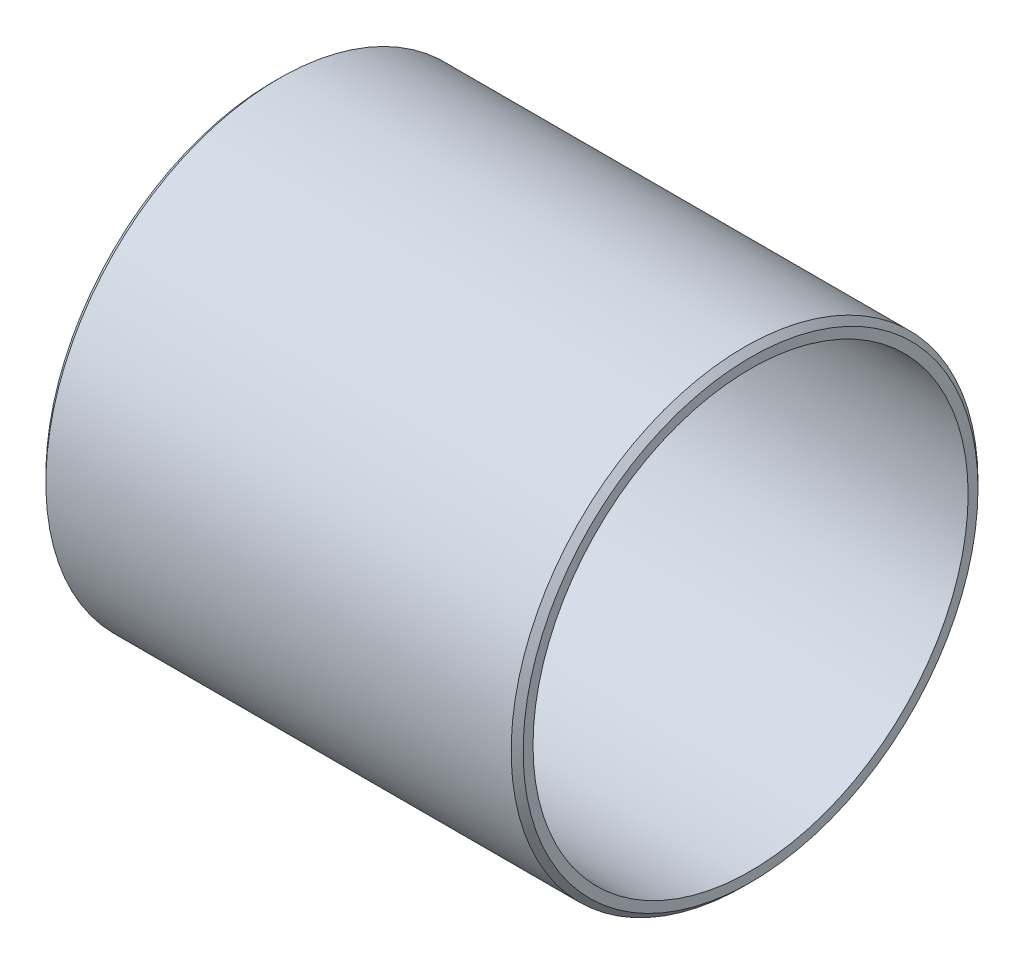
ISO-10303-21;
HEADER;
FILE_DESCRIPTION(('STEP AP214'),'2;1');
FILE_NAME('part.step','',(''),(''),'','','');
FILE_SCHEMA(('AUTOMOTIVE_DESIGN { 1 0 10303 214 1 1 1 1 }'));
ENDSEC;
DATA;
#1=APPLICATION_CONTEXT('core data for automotive mechanical design processes');
#2=APPLICATION_PROTOCOL_DEFINITION('international standard','automotive_design',2000,#1);
#3=PRODUCT_CONTEXT('',#1,'mechanical');
#4=PRODUCT('Part','Part','',(#3));
#5=PRODUCT_RELATED_PRODUCT_CATEGORY('part','',(#4));
#6=PRODUCT_DEFINITION_FORMATION('','',#4);
#7=PRODUCT_DEFINITION_CONTEXT('part definition',#1,'design');
#8=PRODUCT_DEFINITION('design','',#6,#7);
#9=PRODUCT_DEFINITION_SHAPE('','',#8);
#10=(LENGTH_UNIT() NAMED_UNIT(*) SI_UNIT(.MILLI.,.METRE.));
#11=(NAMED_UNIT(*) PLANE_ANGLE_UNIT() SI_UNIT($,.RADIAN.));
#12=(NAMED_UNIT(*) SI_UNIT($,.STERADIAN.) SOLID_ANGLE_UNIT());
#13=UNCERTAINTY_MEASURE_WITH_UNIT(LENGTH_MEASURE(1.E-05),#10,'distance_accuracy_value','');
#14=(GEOMETRIC_REPRESENTATION_CONTEXT(3) GLOBAL_UNCERTAINTY_ASSIGNED_CONTEXT((#13)) GLOBAL_UNIT_ASSIGNED_CONTEXT((#10,
#11,#12)) REPRESENTATION_CONTEXT('',''));
#15=CARTESIAN_POINT('',(0.,0.,0.));
#16=DIRECTION('',(0.,0.,1.));
#17=DIRECTION('',(1.,0.,0.));
#18=AXIS2_PLACEMENT_3D('',#15,#16,#17);
#19=CARTESIAN_POINT('',(31.623,0.,0.));
#20=DIRECTION('',(1.,0.,0.));
#21=DIRECTION('',(0.,0.,-1.));
#22=AXIS2_PLACEMENT_3D('',#19,#20,#21);
#23=PLANE('',#22);
#24=CARTESIAN_POINT('',(31.623,0.,0.));
#25=DIRECTION('',(1.,0.,0.));
#26=DIRECTION('',(0.,0.,-1.));
#27=AXIS2_PLACEMENT_3D('',#24,#25,#26);
#28=CIRCLE('',#27,30.1371);
#29=CARTESIAN_POINT('',(31.623,0.,-30.1371));
#30=VERTEX_POINT('',#29);
#31=EDGE_CURVE('E46',#30,#30,#28,.T.);
#32=ORIENTED_EDGE('',*,*,#31,.T.);
#33=EDGE_LOOP('',(#32));
#34=FACE_BOUND('',#33,.T.);
#35=CARTESIAN_POINT('',(31.623,0.,0.));
#36=DIRECTION('',(1.,0.,0.));
#37=DIRECTION('',(0.,0.,-1.));
#38=AXIS2_PLACEMENT_3D('',#35,#36,#37);
#39=CIRCLE('',#38,28.829);
#40=CARTESIAN_POINT('',(31.623,0.,-28.829));
#41=VERTEX_POINT('',#40);
#42=EDGE_CURVE('E51',#41,#41,#39,.T.);
#43=ORIENTED_EDGE('',*,*,#42,.F.);
#44=EDGE_LOOP('',(#43));
#45=FACE_BOUND('',#44,.T.);
#46=ADVANCED_FACE('F31',(#34,#45),#23,.T.);
#47=CARTESIAN_POINT('',(-31.623,0.,0.));
#48=DIRECTION('',(1.,0.,0.));
#49=DIRECTION('',(0.,0.,-1.));
#50=AXIS2_PLACEMENT_3D('',#47,#48,#49);
#51=PLANE('',#50);
#52=CARTESIAN_POINT('',(-31.623,0.,0.));
#53=DIRECTION('',(1.,0.,0.));
#54=DIRECTION('',(0.,0.,-1.));
#55=AXIS2_PLACEMENT_3D('',#52,#53,#54);
#56=CIRCLE('',#55,30.1371);
#57=CARTESIAN_POINT('',(-31.623,0.,-30.1371));
#58=VERTEX_POINT('',#57);
#59=EDGE_CURVE('E10',#58,#58,#56,.F.);
#60=ORIENTED_EDGE('',*,*,#59,.T.);
#61=EDGE_LOOP('',(#60));
#62=FACE_BOUND('',#61,.T.);
#63=CARTESIAN_POINT('',(-31.623,0.,0.));
#64=DIRECTION('',(1.,0.,0.));
#65=DIRECTION('',(0.,0.,-1.));
#66=AXIS2_PLACEMENT_3D('',#63,#64,#65);
#67=CIRCLE('',#66,28.829);
#68=CARTESIAN_POINT('',(-31.623,0.,-28.829));
#69=VERTEX_POINT('',#68);
#70=EDGE_CURVE('E52',#69,#69,#67,.T.);
#71=ORIENTED_EDGE('',*,*,#70,.T.);
#72=EDGE_LOOP('',(#71));
#73=FACE_BOUND('',#72,.T.);
#74=ADVANCED_FACE('F62',(#62,#73),#51,.F.);
#75=CARTESIAN_POINT('',(31.623,0.,0.));
#76=DIRECTION('',(-1.,0.,0.));
#77=DIRECTION('',(0.,0.,1.));
#78=AXIS2_PLACEMENT_3D('',#75,#76,#77);
#79=CYLINDRICAL_SURFACE('',#78,30.93085);
#80=CARTESIAN_POINT('',(30.82925,0.,0.));
#81=DIRECTION('',(1.,0.,0.));
#82=DIRECTION('',(0.,0.,-1.));
#83=AXIS2_PLACEMENT_3D('',#80,#81,#82);
#84=CIRCLE('',#83,30.93085);
#85=CARTESIAN_POINT('',(30.82925,0.,-30.93085));
#86=VERTEX_POINT('',#85);
#87=EDGE_CURVE('E38',#86,#86,#84,.F.);
#88=ORIENTED_EDGE('',*,*,#87,.T.);
#89=EDGE_LOOP('',(#88));
#90=FACE_BOUND('',#89,.T.);
#91=CARTESIAN_POINT('',(-30.82925,0.,0.));
#92=DIRECTION('',(1.,0.,0.));
#93=DIRECTION('',(0.,0.,-1.));
#94=AXIS2_PLACEMENT_3D('',#91,#92,#93);
#95=CIRCLE('',#94,30.93085);
#96=CARTESIAN_POINT('',(-30.82925,0.,-30.93085));
#97=VERTEX_POINT('',#96);
#98=EDGE_CURVE('E42',#97,#97,#95,.T.);
#99=ORIENTED_EDGE('',*,*,#98,.T.);
#100=EDGE_LOOP('',(#99));
#101=FACE_BOUND('',#100,.T.);
#102=ADVANCED_FACE('F68',(#90,#101),#79,.T.);
#103=CARTESIAN_POINT('',(31.623,0.,0.));
#104=DIRECTION('',(-1.,0.,0.));
#105=DIRECTION('',(0.,0.,1.));
#106=AXIS2_PLACEMENT_3D('',#103,#104,#105);
#107=CYLINDRICAL_SURFACE('',#106,28.829);
#108=ORIENTED_EDGE('',*,*,#42,.T.);
#109=EDGE_LOOP('',(#108));
#110=FACE_BOUND('',#109,.T.);
#111=ORIENTED_EDGE('',*,*,#70,.F.);
#112=EDGE_LOOP('',(#111));
#113=FACE_BOUND('',#112,.T.);
#114=ADVANCED_FACE('F58',(#110,#113),#107,.F.);
#115=CARTESIAN_POINT('',(31.623,0.,0.));
#116=DIRECTION('',(-1.,0.,0.));
#117=DIRECTION('',(0.,0.,1.));
#118=AXIS2_PLACEMENT_3D('',#115,#116,#117);
#119=CONICAL_SURFACE('',#118,30.1371,0.785398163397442);
#120=ORIENTED_EDGE('',*,*,#87,.F.);
#121=EDGE_LOOP('',(#120));
#122=FACE_BOUND('',#121,.T.);
#123=ORIENTED_EDGE('',*,*,#31,.F.);
#124=EDGE_LOOP('',(#123));
#125=FACE_BOUND('',#124,.T.);
#126=ADVANCED_FACE('F73',(#122,#125),#119,.T.);
#127=CARTESIAN_POINT('',(-30.82925,0.,0.));
#128=DIRECTION('',(1.,0.,0.));
#129=DIRECTION('',(0.,0.,-1.));
#130=AXIS2_PLACEMENT_3D('',#127,#128,#129);
#131=CONICAL_SURFACE('',#130,30.93085,0.785398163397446);
#132=ORIENTED_EDGE('',*,*,#59,.F.);
#133=EDGE_LOOP('',(#132));
#134=FACE_BOUND('',#133,.T.);
#135=ORIENTED_EDGE('',*,*,#98,.F.);
#136=EDGE_LOOP('',(#135));
#137=FACE_BOUND('',#136,.T.);
#138=ADVANCED_FACE('F33',(#134,#137),#131,.T.);
#139=CLOSED_SHELL('',(#46,#74,#102,#114,#126,#138));
#140=MANIFOLD_SOLID_BREP('B2',#139);
#141=ADVANCED_BREP_SHAPE_REPRESENTATION('',(#18,#140),#14);
#142=SHAPE_DEFINITION_REPRESENTATION(#9,#141);
ENDSEC;
END-ISO-10303-21;
